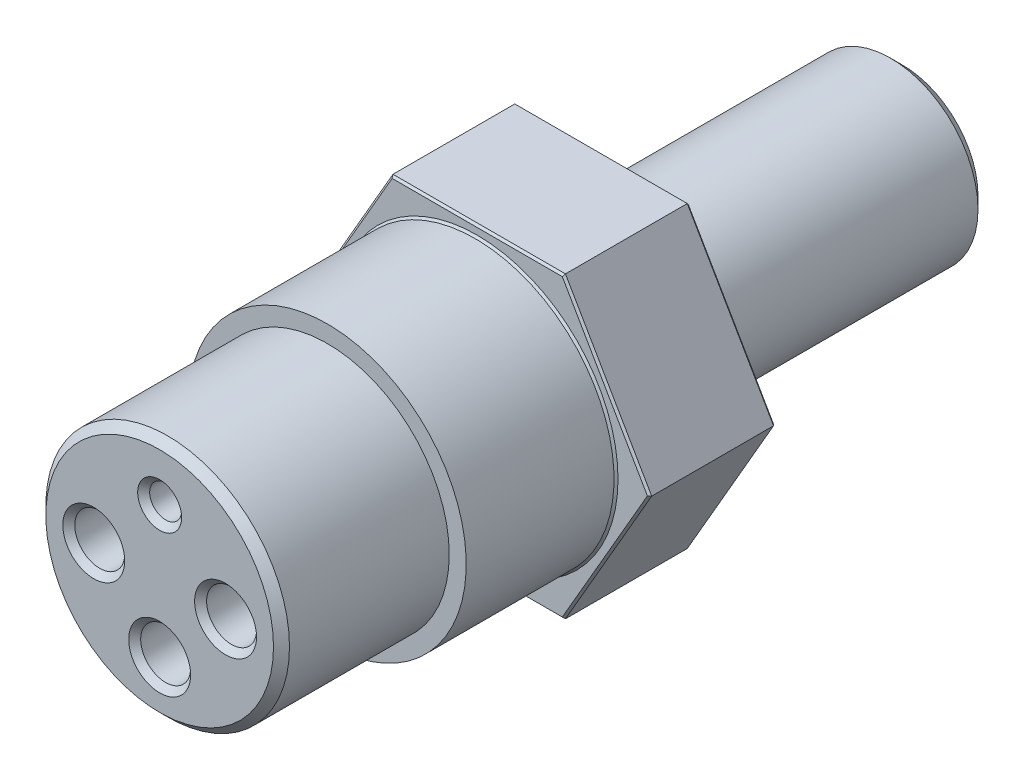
ISO-10303-21;
HEADER;
FILE_DESCRIPTION(('STEP AP214'),'2;1');
FILE_NAME('part.step','',(''),(''),'','','');
FILE_SCHEMA(('AUTOMOTIVE_DESIGN { 1 0 10303 214 1 1 1 1 }'));
ENDSEC;
DATA;
#1=APPLICATION_CONTEXT('core data for automotive mechanical design processes');
#2=APPLICATION_PROTOCOL_DEFINITION('international standard','automotive_design',2000,#1);
#3=PRODUCT_CONTEXT('',#1,'mechanical');
#4=PRODUCT('Part','Part','',(#3));
#5=PRODUCT_RELATED_PRODUCT_CATEGORY('part','',(#4));
#6=PRODUCT_DEFINITION_FORMATION('','',#4);
#7=PRODUCT_DEFINITION_CONTEXT('part definition',#1,'design');
#8=PRODUCT_DEFINITION('design','',#6,#7);
#9=PRODUCT_DEFINITION_SHAPE('','',#8);
#10=(LENGTH_UNIT() NAMED_UNIT(*) SI_UNIT(.MILLI.,.METRE.));
#11=(NAMED_UNIT(*) PLANE_ANGLE_UNIT() SI_UNIT($,.RADIAN.));
#12=(NAMED_UNIT(*) SI_UNIT($,.STERADIAN.) SOLID_ANGLE_UNIT());
#13=UNCERTAINTY_MEASURE_WITH_UNIT(LENGTH_MEASURE(1.E-05),#10,'distance_accuracy_value','');
#14=(GEOMETRIC_REPRESENTATION_CONTEXT(3) GLOBAL_UNCERTAINTY_ASSIGNED_CONTEXT((#13)) GLOBAL_UNIT_ASSIGNED_CONTEXT((#10,
#11,#12)) REPRESENTATION_CONTEXT('',''));
#15=CARTESIAN_POINT('',(0.,0.,0.));
#16=DIRECTION('',(0.,0.,1.));
#17=DIRECTION('',(1.,0.,0.));
#18=AXIS2_PLACEMENT_3D('',#15,#16,#17);
#19=CARTESIAN_POINT('',(0.,0.,17.526));
#20=DIRECTION('',(0.,0.,1.));
#21=DIRECTION('',(1.,0.,0.));
#22=AXIS2_PLACEMENT_3D('',#19,#20,#21);
#23=PLANE('',#22);
#24=CARTESIAN_POINT('',(0.,0.,17.526));
#25=DIRECTION('',(0.,0.,1.));
#26=DIRECTION('',(1.,0.,0.));
#27=AXIS2_PLACEMENT_3D('',#24,#25,#26);
#28=CIRCLE('',#27,8.8265);
#29=CARTESIAN_POINT('',(-8.8265,0.,17.526));
#30=VERTEX_POINT('',#29);
#31=EDGE_CURVE('E331',#30,#30,#28,.T.);
#32=ORIENTED_EDGE('',*,*,#31,.T.);
#33=EDGE_LOOP('',(#32));
#34=FACE_BOUND('',#33,.T.);
#35=CARTESIAN_POINT('',(0.,0.,17.526));
#36=DIRECTION('',(0.,0.,1.));
#37=DIRECTION('',(1.,0.,0.));
#38=AXIS2_PLACEMENT_3D('',#35,#36,#37);
#39=CIRCLE('',#38,7.747);
#40=CARTESIAN_POINT('',(7.747,0.,17.526));
#41=VERTEX_POINT('',#40);
#42=EDGE_CURVE('E367',#41,#41,#39,.T.);
#43=ORIENTED_EDGE('',*,*,#42,.F.);
#44=EDGE_LOOP('',(#43));
#45=FACE_BOUND('',#44,.T.);
#46=ADVANCED_FACE('F36',(#34,#45),#23,.T.);
#47=CARTESIAN_POINT('',(5.48459661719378,9.4996,8.001));
#48=DIRECTION('',(0.,0.,-1.));
#49=DIRECTION('',(-1.,0.,0.));
#50=AXIS2_PLACEMENT_3D('',#47,#48,#49);
#51=PLANE('',#50);
#52=CARTESIAN_POINT('',(0.,0.,8.001));
#53=DIRECTION('',(0.,0.,-1.));
#54=DIRECTION('',(-1.,0.,0.));
#55=AXIS2_PLACEMENT_3D('',#52,#53,#54);
#56=CIRCLE('',#55,8.95350000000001);
#57=CARTESIAN_POINT('',(-8.95350000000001,0.,8.001));
#58=VERTEX_POINT('',#57);
#59=EDGE_CURVE('E151',#58,#58,#56,.T.);
#60=ORIENTED_EDGE('',*,*,#59,.T.);
#61=EDGE_LOOP('',(#60));
#62=FACE_BOUND('',#61,.T.);
#63=DIRECTION('',(0.5,0.866025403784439,0.));
#64=VECTOR('',#63,1.);
#65=CARTESIAN_POINT('',(13.6015063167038,4.8133,8.001));
#66=LINE('',#65,#64);
#67=CARTESIAN_POINT('',(5.41127313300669,-9.3726,8.001));
#68=VERTEX_POINT('',#67);
#69=CARTESIAN_POINT('',(10.8225462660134,0.,8.001));
#70=VERTEX_POINT('',#69);
#71=EDGE_CURVE('E149',#68,#70,#66,.T.);
#72=ORIENTED_EDGE('',*,*,#71,.T.);
#73=DIRECTION('',(-0.5,0.866025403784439,0.));
#74=VECTOR('',#73,1.);
#75=CARTESIAN_POINT('',(5.37461139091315,9.4361,8.001));
#76=LINE('',#75,#74);
#77=CARTESIAN_POINT('',(5.41127313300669,9.37260000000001,8.001));
#78=VERTEX_POINT('',#77);
#79=EDGE_CURVE('E129',#70,#78,#76,.T.);
#80=ORIENTED_EDGE('',*,*,#79,.T.);
#81=DIRECTION('',(-1.,0.,0.));
#82=VECTOR('',#81,1.);
#83=CARTESIAN_POINT('',(5.48459661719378,9.37260000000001,8.001));
#84=LINE('',#83,#82);
#85=CARTESIAN_POINT('',(-5.41127313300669,9.3726,8.001));
#86=VERTEX_POINT('',#85);
#87=EDGE_CURVE('E138',#78,#86,#84,.T.);
#88=ORIENTED_EDGE('',*,*,#87,.T.);
#89=DIRECTION('',(-0.5,-0.866025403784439,0.));
#90=VECTOR('',#89,1.);
#91=CARTESIAN_POINT('',(-2.63231308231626,14.1859,8.001));
#92=LINE('',#91,#90);
#93=CARTESIAN_POINT('',(-10.8225462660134,0.,8.001));
#94=VERTEX_POINT('',#93);
#95=EDGE_CURVE('E144',#86,#94,#92,.T.);
#96=ORIENTED_EDGE('',*,*,#95,.T.);
#97=DIRECTION('',(0.5,-0.866025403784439,0.));
#98=VECTOR('',#97,1.);
#99=CARTESIAN_POINT('',(-10.8592080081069,0.0634999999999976,8.001));
#100=LINE('',#99,#98);
#101=CARTESIAN_POINT('',(-5.41127313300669,-9.3726,8.001));
#102=VERTEX_POINT('',#101);
#103=EDGE_CURVE('E307',#94,#102,#100,.T.);
#104=ORIENTED_EDGE('',*,*,#103,.T.);
#105=DIRECTION('',(1.,0.,0.));
#106=VECTOR('',#105,1.);
#107=CARTESIAN_POINT('',(5.48459661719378,-9.3726,8.001));
#108=LINE('',#107,#106);
#109=EDGE_CURVE('E156',#102,#68,#108,.T.);
#110=ORIENTED_EDGE('',*,*,#109,.T.);
#111=EDGE_LOOP('',(#72,#80,#88,#96,#104,#110));
#112=FACE_BOUND('',#111,.T.);
#113=ADVANCED_FACE('F147',(#62,#112),#51,.F.);
#114=CARTESIAN_POINT('',(0.,0.,-19.05));
#115=DIRECTION('',(0.,0.,1.));
#116=DIRECTION('',(1.,0.,0.));
#117=AXIS2_PLACEMENT_3D('',#114,#115,#116);
#118=CYLINDRICAL_SURFACE('',#117,5.55625);
#119=CARTESIAN_POINT('',(0.,0.,-18.288));
#120=DIRECTION('',(0.,0.,1.));
#121=DIRECTION('',(1.,0.,0.));
#122=AXIS2_PLACEMENT_3D('',#119,#120,#121);
#123=CIRCLE('',#122,5.55625);
#124=CARTESIAN_POINT('',(5.55625,0.,-18.288));
#125=VERTEX_POINT('',#124);
#126=EDGE_CURVE('E297',#125,#125,#123,.T.);
#127=CARTESIAN_POINT('',(0.,0.,0.));
#128=DIRECTION('',(0.,0.,1.));
#129=DIRECTION('',(1.,0.,0.));
#130=AXIS2_PLACEMENT_3D('',#127,#128,#129);
#131=CIRCLE('',#130,5.55625);
#132=CARTESIAN_POINT('',(5.55625,0.,0.));
#133=VERTEX_POINT('',#132);
#134=EDGE_CURVE('E302',#133,#133,#131,.T.);
#135=CARTESIAN_POINT('',(5.55625,0.,-18.288));
#136=CARTESIAN_POINT('',(5.55625,0.,-18.0975));
#137=CARTESIAN_POINT('',(5.55625,0.,-17.907));
#138=CARTESIAN_POINT('',(5.55625,0.,-17.526));
#139=CARTESIAN_POINT('',(5.55625,0.,-17.3355));
#140=CARTESIAN_POINT('',(5.55625,0.,-16.9545));
#141=CARTESIAN_POINT('',(5.55625,0.,-16.764));
#142=CARTESIAN_POINT('',(5.55625,0.,-16.383));
#143=CARTESIAN_POINT('',(5.55625,0.,-16.1925));
#144=CARTESIAN_POINT('',(5.55625,0.,-15.8115));
#145=CARTESIAN_POINT('',(5.55625,0.,-15.621));
#146=CARTESIAN_POINT('',(5.55625,0.,-15.24));
#147=CARTESIAN_POINT('',(5.55625,0.,-15.0495));
#148=CARTESIAN_POINT('',(5.55625,0.,-14.6685));
#149=CARTESIAN_POINT('',(5.55625,0.,-14.478));
#150=CARTESIAN_POINT('',(5.55625,0.,-14.097));
#151=CARTESIAN_POINT('',(5.55625,0.,-13.9065));
#152=CARTESIAN_POINT('',(5.55625,0.,-13.5255));
#153=CARTESIAN_POINT('',(5.55625,0.,-13.335));
#154=CARTESIAN_POINT('',(5.55625,0.,-12.954));
#155=CARTESIAN_POINT('',(5.55625,0.,-12.7635));
#156=CARTESIAN_POINT('',(5.55625,0.,-12.3825));
#157=CARTESIAN_POINT('',(5.55625,0.,-12.192));
#158=CARTESIAN_POINT('',(5.55625,0.,-11.811));
#159=CARTESIAN_POINT('',(5.55625,0.,-11.6205));
#160=CARTESIAN_POINT('',(5.55625,0.,-11.2395));
#161=CARTESIAN_POINT('',(5.55625,0.,-11.049));
#162=CARTESIAN_POINT('',(5.55625,0.,-10.668));
#163=CARTESIAN_POINT('',(5.55625,0.,-10.4775));
#164=CARTESIAN_POINT('',(5.55625,0.,-10.0965));
#165=CARTESIAN_POINT('',(5.55625,0.,-9.906));
#166=CARTESIAN_POINT('',(5.55625,0.,-9.525));
#167=CARTESIAN_POINT('',(5.55625,0.,-9.3345));
#168=CARTESIAN_POINT('',(5.55625,0.,-8.9535));
#169=CARTESIAN_POINT('',(5.55625,0.,-8.763));
#170=CARTESIAN_POINT('',(5.55625,0.,-8.382));
#171=CARTESIAN_POINT('',(5.55625,0.,-8.1915));
#172=CARTESIAN_POINT('',(5.55625,0.,-7.8105));
#173=CARTESIAN_POINT('',(5.55625,0.,-7.62));
#174=CARTESIAN_POINT('',(5.55625,0.,-7.239));
#175=CARTESIAN_POINT('',(5.55625,0.,-7.0485));
#176=CARTESIAN_POINT('',(5.55625,0.,-6.6675));
#177=CARTESIAN_POINT('',(5.55625,0.,-6.477));
#178=CARTESIAN_POINT('',(5.55625,0.,-6.096));
#179=CARTESIAN_POINT('',(5.55625,0.,-5.9055));
#180=CARTESIAN_POINT('',(5.55625,0.,-5.5245));
#181=CARTESIAN_POINT('',(5.55625,0.,-5.334));
#182=CARTESIAN_POINT('',(5.55625,0.,-4.953));
#183=CARTESIAN_POINT('',(5.55625,0.,-4.7625));
#184=CARTESIAN_POINT('',(5.55625,0.,-4.3815));
#185=CARTESIAN_POINT('',(5.55625,0.,-4.191));
#186=CARTESIAN_POINT('',(5.55625,0.,-3.81));
#187=CARTESIAN_POINT('',(5.55625,0.,-3.6195));
#188=CARTESIAN_POINT('',(5.55625,0.,-3.2385));
#189=CARTESIAN_POINT('',(5.55625,0.,-3.048));
#190=CARTESIAN_POINT('',(5.55625,0.,-2.667));
#191=CARTESIAN_POINT('',(5.55625,0.,-2.4765));
#192=CARTESIAN_POINT('',(5.55625,0.,-2.0955));
#193=CARTESIAN_POINT('',(5.55625,0.,-1.905));
#194=CARTESIAN_POINT('',(5.55625,0.,-1.524));
#195=CARTESIAN_POINT('',(5.55625,0.,-1.3335));
#196=CARTESIAN_POINT('',(5.55625,0.,-0.952499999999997));
#197=CARTESIAN_POINT('',(5.55625,0.,-0.761999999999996));
#198=CARTESIAN_POINT('',(5.55625,0.,-0.380999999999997));
#199=CARTESIAN_POINT('',(5.55625,0.,-0.190499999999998));
#200=CARTESIAN_POINT('',(5.55625,0.,0.));
#201=B_SPLINE_CURVE_WITH_KNOTS('',3,(#135,#136,#137,#138,#139,#140,#141,#142,#143,#144,#145,
#146,#147,#148,#149,#150,#151,#152,#153,#154,#155,#156,#157,#158,#159,#160,#161,#162,#163,#164,
#165,#166,#167,#168,#169,#170,#171,#172,#173,#174,#175,#176,#177,#178,#179,#180,#181,#182,#183,
#184,#185,#186,#187,#188,#189,#190,#191,#192,#193,#194,#195,#196,#197,#198,#199,#200),
.UNSPECIFIED.,.F.,.F.,(4,2,2,2,2,2,2,2,2,2,2,2,2,2,2,2,2,2,2,2,2,2,2,2,2,2,2,2,2,2,2,2,4),(0.,
0.571500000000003,1.143,1.7145,2.286,2.8575,3.429,4.0005,4.572,5.1435,5.715,6.2865,6.858,7.4295,
8.001,8.5725,9.144,9.7155,10.287,10.8585,11.43,12.0015,12.573,13.1445,13.716,14.2875,14.859,
15.4305,16.002,16.5735,17.145,17.7165,18.288),.UNSPECIFIED.);
#202=EDGE_CURVE('BSEAM38',#125,#133,#201,.T.);
#203=ORIENTED_EDGE('',*,*,#126,.T.);
#204=ORIENTED_EDGE('',*,*,#134,.F.);
#205=ORIENTED_EDGE('',*,*,#202,.T.);
#206=ORIENTED_EDGE('',*,*,#202,.F.);
#207=EDGE_LOOP('',(#203,#205,#204,#206));
#208=FACE_BOUND('',#207,.T.);
#209=ADVANCED_FACE('F38',(#208),#118,.T.);
#210=CARTESIAN_POINT('',(0.,0.,-19.05));
#211=DIRECTION('',(0.,0.,1.));
#212=DIRECTION('',(1.,0.,0.));
#213=AXIS2_PLACEMENT_3D('',#210,#211,#212);
#214=PLANE('',#213);
#215=CARTESIAN_POINT('',(0.,0.,-19.05));
#216=DIRECTION('',(0.,0.,1.));
#217=DIRECTION('',(1.,0.,0.));
#218=AXIS2_PLACEMENT_3D('',#215,#216,#217);
#219=CIRCLE('',#218,4.79425);
#220=CARTESIAN_POINT('',(4.79425,0.,-19.05));
#221=VERTEX_POINT('',#220);
#222=EDGE_CURVE('E296',#221,#221,#219,.F.);
#223=ORIENTED_EDGE('',*,*,#222,.T.);
#224=EDGE_LOOP('',(#223));
#225=FACE_BOUND('',#224,.T.);
#226=ADVANCED_FACE('F286',(#225),#214,.F.);
#227=CARTESIAN_POINT('',(0.,0.,-18.288));
#228=DIRECTION('',(0.,0.,1.));
#229=DIRECTION('',(1.,0.,0.));
#230=AXIS2_PLACEMENT_3D('',#227,#228,#229);
#231=CONICAL_SURFACE('',#230,5.55625,0.785398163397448);
#232=ORIENTED_EDGE('',*,*,#222,.F.);
#233=EDGE_LOOP('',(#232));
#234=FACE_BOUND('',#233,.T.);
#235=ORIENTED_EDGE('',*,*,#126,.F.);
#236=EDGE_LOOP('',(#235));
#237=FACE_BOUND('',#236,.T.);
#238=ADVANCED_FACE('F283',(#234,#237),#231,.T.);
#239=CARTESIAN_POINT('',(5.48459661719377,9.4996,8.001));
#240=DIRECTION('',(0.,-1.,0.));
#241=DIRECTION('',(1.,0.,0.));
#242=AXIS2_PLACEMENT_3D('',#239,#240,#241);
#243=PLANE('',#242);
#244=DIRECTION('',(0.,0.,-1.));
#245=VECTOR('',#244,1.);
#246=CARTESIAN_POINT('',(-5.48459661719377,9.4996,8.001));
#247=LINE('',#246,#245);
#248=CARTESIAN_POINT('',(-5.48459661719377,9.4996,7.874));
#249=VERTEX_POINT('',#248);
#250=CARTESIAN_POINT('',(-5.48459661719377,9.4996,0.126999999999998));
#251=VERTEX_POINT('',#250);
#252=EDGE_CURVE('E351',#249,#251,#247,.T.);
#253=ORIENTED_EDGE('',*,*,#252,.F.);
#254=DIRECTION('',(1.,0.,0.));
#255=VECTOR('',#254,1.);
#256=CARTESIAN_POINT('',(5.48459661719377,9.4996,7.874));
#257=LINE('',#256,#255);
#258=CARTESIAN_POINT('',(5.48459661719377,9.4996,7.874));
#259=VERTEX_POINT('',#258);
#260=EDGE_CURVE('E183',#249,#259,#257,.T.);
#261=ORIENTED_EDGE('',*,*,#260,.T.);
#262=DIRECTION('',(0.,0.,-1.));
#263=VECTOR('',#262,1.);
#264=CARTESIAN_POINT('',(5.48459661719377,9.4996,8.001));
#265=LINE('',#264,#263);
#266=CARTESIAN_POINT('',(5.48459661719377,9.4996,0.127));
#267=VERTEX_POINT('',#266);
#268=EDGE_CURVE('E336',#259,#267,#265,.T.);
#269=ORIENTED_EDGE('',*,*,#268,.T.);
#270=DIRECTION('',(-1.,0.,0.));
#271=VECTOR('',#270,1.);
#272=CARTESIAN_POINT('',(-5.48459661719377,9.4996,0.127));
#273=LINE('',#272,#271);
#274=EDGE_CURVE('E180',#267,#251,#273,.T.);
#275=ORIENTED_EDGE('',*,*,#274,.T.);
#276=EDGE_LOOP('',(#253,#261,#269,#275));
#277=FACE_BOUND('',#276,.T.);
#278=ADVANCED_FACE('F279',(#277),#243,.F.);
#279=CARTESIAN_POINT('',(-5.48459661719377,9.4996,8.001));
#280=DIRECTION('',(0.866025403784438,-0.5,0.));
#281=DIRECTION('',(0.5,0.866025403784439,0.));
#282=AXIS2_PLACEMENT_3D('',#279,#280,#281);
#283=PLANE('',#282);
#284=DIRECTION('',(0.,0.,-1.));
#285=VECTOR('',#284,1.);
#286=CARTESIAN_POINT('',(-10.9691932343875,0.,8.001));
#287=LINE('',#286,#285);
#288=CARTESIAN_POINT('',(-10.9691932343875,0.,7.874));
#289=VERTEX_POINT('',#288);
#290=CARTESIAN_POINT('',(-10.9691932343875,0.,0.127000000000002));
#291=VERTEX_POINT('',#290);
#292=EDGE_CURVE('E348',#289,#291,#287,.T.);
#293=ORIENTED_EDGE('',*,*,#292,.F.);
#294=DIRECTION('',(0.5,0.866025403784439,0.));
#295=VECTOR('',#294,1.);
#296=CARTESIAN_POINT('',(-5.48459661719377,9.4996,7.874));
#297=LINE('',#296,#295);
#298=EDGE_CURVE('E178',#289,#249,#297,.T.);
#299=ORIENTED_EDGE('',*,*,#298,.T.);
#300=ORIENTED_EDGE('',*,*,#252,.T.);
#301=DIRECTION('',(-0.377964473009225,-0.654653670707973,-0.654653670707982));
#302=VECTOR('',#301,1.);
#303=CARTESIAN_POINT('',(-3.91756901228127,12.2137714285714,2.84117142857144));
#304=LINE('',#303,#302);
#305=CARTESIAN_POINT('',(-5.55792010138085,9.3726,0.));
#306=VERTEX_POINT('',#305);
#307=EDGE_CURVE('E176',#251,#306,#304,.T.);
#308=ORIENTED_EDGE('',*,*,#307,.T.);
#309=DIRECTION('',(-0.5,-0.866025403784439,0.));
#310=VECTOR('',#309,1.);
#311=CARTESIAN_POINT('',(-5.48459661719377,9.4996,0.));
#312=LINE('',#311,#310);
#313=CARTESIAN_POINT('',(-10.8958697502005,0.127000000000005,0.));
#314=VERTEX_POINT('',#313);
#315=EDGE_CURVE('E333',#306,#314,#312,.T.);
#316=ORIENTED_EDGE('',*,*,#315,.T.);
#317=DIRECTION('',(-0.377964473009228,-0.654653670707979,0.654653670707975));
#318=VECTOR('',#317,1.);
#319=CARTESIAN_POINT('',(-10.9691932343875,0.,0.127000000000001));
#320=LINE('',#319,#318);
#321=EDGE_CURVE('E174',#314,#291,#320,.T.);
#322=ORIENTED_EDGE('',*,*,#321,.T.);
#323=EDGE_LOOP('',(#293,#299,#300,#308,#316,#322));
#324=FACE_BOUND('',#323,.T.);
#325=ADVANCED_FACE('F275',(#324),#283,.F.);
#326=CARTESIAN_POINT('',(-10.9691932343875,0.,8.001));
#327=DIRECTION('',(0.866025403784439,0.5,0.));
#328=DIRECTION('',(-0.5,0.866025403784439,0.));
#329=AXIS2_PLACEMENT_3D('',#326,#327,#328);
#330=PLANE('',#329);
#331=DIRECTION('',(0.,0.,-1.));
#332=VECTOR('',#331,1.);
#333=CARTESIAN_POINT('',(-5.48459661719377,-9.4996,8.001));
#334=LINE('',#333,#332);
#335=CARTESIAN_POINT('',(-5.48459661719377,-9.4996,7.874));
#336=VERTEX_POINT('',#335);
#337=CARTESIAN_POINT('',(-5.48459661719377,-9.4996,0.127));
#338=VERTEX_POINT('',#337);
#339=EDGE_CURVE('E345',#336,#338,#334,.T.);
#340=ORIENTED_EDGE('',*,*,#339,.F.);
#341=DIRECTION('',(-0.5,0.866025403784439,0.));
#342=VECTOR('',#341,1.);
#343=CARTESIAN_POINT('',(-10.9691932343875,0.,7.874));
#344=LINE('',#343,#342);
#345=EDGE_CURVE('E172',#336,#289,#344,.T.);
#346=ORIENTED_EDGE('',*,*,#345,.T.);
#347=ORIENTED_EDGE('',*,*,#292,.T.);
#348=DIRECTION('',(0.5,-0.866025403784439,0.));
#349=VECTOR('',#348,1.);
#350=CARTESIAN_POINT('',(-5.48459661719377,-9.4996,0.127));
#351=LINE('',#350,#349);
#352=EDGE_CURVE('E170',#291,#338,#351,.T.);
#353=ORIENTED_EDGE('',*,*,#352,.T.);
#354=EDGE_LOOP('',(#340,#346,#347,#353));
#355=FACE_BOUND('',#354,.T.);
#356=ADVANCED_FACE('F271',(#355),#330,.F.);
#357=CARTESIAN_POINT('',(-5.48459661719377,-9.4996,8.001));
#358=DIRECTION('',(0.,1.,0.));
#359=DIRECTION('',(-1.,0.,0.));
#360=AXIS2_PLACEMENT_3D('',#357,#358,#359);
#361=PLANE('',#360);
#362=DIRECTION('',(0.,0.,-1.));
#363=VECTOR('',#362,1.);
#364=CARTESIAN_POINT('',(5.48459661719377,-9.4996,8.001));
#365=LINE('',#364,#363);
#366=CARTESIAN_POINT('',(5.48459661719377,-9.4996,7.874));
#367=VERTEX_POINT('',#366);
#368=CARTESIAN_POINT('',(5.48459661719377,-9.4996,0.127));
#369=VERTEX_POINT('',#368);
#370=EDGE_CURVE('E342',#367,#369,#365,.T.);
#371=ORIENTED_EDGE('',*,*,#370,.F.);
#372=DIRECTION('',(-1.,0.,0.));
#373=VECTOR('',#372,1.);
#374=CARTESIAN_POINT('',(-5.48459661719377,-9.4996,7.874));
#375=LINE('',#374,#373);
#376=EDGE_CURVE('E168',#367,#336,#375,.T.);
#377=ORIENTED_EDGE('',*,*,#376,.T.);
#378=ORIENTED_EDGE('',*,*,#339,.T.);
#379=DIRECTION('',(1.,0.,0.));
#380=VECTOR('',#379,1.);
#381=CARTESIAN_POINT('',(5.48459661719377,-9.4996,0.127));
#382=LINE('',#381,#380);
#383=EDGE_CURVE('E166',#338,#369,#382,.T.);
#384=ORIENTED_EDGE('',*,*,#383,.T.);
#385=EDGE_LOOP('',(#371,#377,#378,#384));
#386=FACE_BOUND('',#385,.T.);
#387=ADVANCED_FACE('F267',(#386),#361,.F.);
#388=CARTESIAN_POINT('',(5.48459661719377,-9.4996,8.001));
#389=DIRECTION('',(-0.866025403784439,0.5,0.));
#390=DIRECTION('',(-0.5,-0.866025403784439,0.));
#391=AXIS2_PLACEMENT_3D('',#388,#389,#390);
#392=PLANE('',#391);
#393=DIRECTION('',(0.,0.,-1.));
#394=VECTOR('',#393,1.);
#395=CARTESIAN_POINT('',(10.9691932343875,0.,8.001));
#396=LINE('',#395,#394);
#397=CARTESIAN_POINT('',(10.9691932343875,0.,7.874));
#398=VERTEX_POINT('',#397);
#399=CARTESIAN_POINT('',(10.9691932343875,0.,0.127));
#400=VERTEX_POINT('',#399);
#401=EDGE_CURVE('E339',#398,#400,#396,.T.);
#402=ORIENTED_EDGE('',*,*,#401,.F.);
#403=DIRECTION('',(-0.5,-0.866025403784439,0.));
#404=VECTOR('',#403,1.);
#405=CARTESIAN_POINT('',(5.48459661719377,-9.4996,7.874));
#406=LINE('',#405,#404);
#407=EDGE_CURVE('E164',#398,#367,#406,.T.);
#408=ORIENTED_EDGE('',*,*,#407,.T.);
#409=ORIENTED_EDGE('',*,*,#370,.T.);
#410=DIRECTION('',(0.5,0.866025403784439,0.));
#411=VECTOR('',#410,1.);
#412=CARTESIAN_POINT('',(10.9691932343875,0.,0.127));
#413=LINE('',#412,#411);
#414=EDGE_CURVE('E162',#369,#400,#413,.T.);
#415=ORIENTED_EDGE('',*,*,#414,.T.);
#416=EDGE_LOOP('',(#402,#408,#409,#415));
#417=FACE_BOUND('',#416,.T.);
#418=ADVANCED_FACE('F263',(#417),#392,.F.);
#419=CARTESIAN_POINT('',(10.9691932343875,0.,8.001));
#420=DIRECTION('',(-0.866025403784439,-0.5,0.));
#421=DIRECTION('',(0.5,-0.866025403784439,0.));
#422=AXIS2_PLACEMENT_3D('',#419,#420,#421);
#423=PLANE('',#422);
#424=ORIENTED_EDGE('',*,*,#268,.F.);
#425=DIRECTION('',(0.5,-0.866025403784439,0.));
#426=VECTOR('',#425,1.);
#427=CARTESIAN_POINT('',(10.9691932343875,0.,7.874));
#428=LINE('',#427,#426);
#429=EDGE_CURVE('E131',#259,#398,#428,.T.);
#430=ORIENTED_EDGE('',*,*,#429,.T.);
#431=ORIENTED_EDGE('',*,*,#401,.T.);
#432=DIRECTION('',(-0.5,0.866025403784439,0.));
#433=VECTOR('',#432,1.);
#434=CARTESIAN_POINT('',(5.48459661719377,9.4996,0.127));
#435=LINE('',#434,#433);
#436=EDGE_CURVE('E154',#400,#267,#435,.T.);
#437=ORIENTED_EDGE('',*,*,#436,.T.);
#438=EDGE_LOOP('',(#424,#430,#431,#437));
#439=FACE_BOUND('',#438,.T.);
#440=ADVANCED_FACE('F258',(#439),#423,.F.);
#441=CARTESIAN_POINT('',(5.48459661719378,9.4996,0.));
#442=DIRECTION('',(0.,0.,-1.));
#443=DIRECTION('',(-1.,0.,0.));
#444=AXIS2_PLACEMENT_3D('',#441,#442,#443);
#445=PLANE('',#444);
#446=ORIENTED_EDGE('',*,*,#134,.T.);
#447=EDGE_LOOP('',(#446));
#448=FACE_BOUND('',#447,.T.);
#449=ORIENTED_EDGE('',*,*,#315,.F.);
#450=DIRECTION('',(1.,0.,0.));
#451=VECTOR('',#450,1.);
#452=CARTESIAN_POINT('',(5.48459661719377,9.37260000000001,0.));
#453=LINE('',#452,#451);
#454=CARTESIAN_POINT('',(5.41127313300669,9.37260000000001,0.));
#455=VERTEX_POINT('',#454);
#456=EDGE_CURVE('E51',#306,#455,#453,.T.);
#457=ORIENTED_EDGE('',*,*,#456,.T.);
#458=DIRECTION('',(0.5,-0.866025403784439,0.));
#459=VECTOR('',#458,1.);
#460=CARTESIAN_POINT('',(10.8592080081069,-0.0634999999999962,0.));
#461=LINE('',#460,#459);
#462=CARTESIAN_POINT('',(10.8225462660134,0.,0.));
#463=VERTEX_POINT('',#462);
#464=EDGE_CURVE('E55',#455,#463,#461,.T.);
#465=ORIENTED_EDGE('',*,*,#464,.T.);
#466=DIRECTION('',(-0.5,-0.866025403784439,0.));
#467=VECTOR('',#466,1.);
#468=CARTESIAN_POINT('',(5.37461139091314,-9.43609999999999,0.));
#469=LINE('',#468,#467);
#470=CARTESIAN_POINT('',(5.41127313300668,-9.3726,0.));
#471=VERTEX_POINT('',#470);
#472=EDGE_CURVE('E189',#463,#471,#469,.T.);
#473=ORIENTED_EDGE('',*,*,#472,.T.);
#474=DIRECTION('',(-1.,0.,0.));
#475=VECTOR('',#474,1.);
#476=CARTESIAN_POINT('',(-5.48459661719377,-9.3726,0.));
#477=LINE('',#476,#475);
#478=CARTESIAN_POINT('',(-5.41127313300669,-9.3726,0.));
#479=VERTEX_POINT('',#478);
#480=EDGE_CURVE('E187',#471,#479,#477,.T.);
#481=ORIENTED_EDGE('',*,*,#480,.T.);
#482=DIRECTION('',(-0.5,0.866025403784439,0.));
#483=VECTOR('',#482,1.);
#484=CARTESIAN_POINT('',(-10.8592080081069,0.0635000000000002,0.));
#485=LINE('',#484,#483);
#486=EDGE_CURVE('E185',#479,#314,#485,.T.);
#487=ORIENTED_EDGE('',*,*,#486,.T.);
#488=EDGE_LOOP('',(#449,#457,#465,#473,#481,#487));
#489=FACE_BOUND('',#488,.T.);
#490=ADVANCED_FACE('F255',(#448,#489),#445,.T.);
#491=CARTESIAN_POINT('',(0.,0.,17.526));
#492=DIRECTION('',(0.,0.,-1.));
#493=DIRECTION('',(-1.,0.,0.));
#494=AXIS2_PLACEMENT_3D('',#491,#492,#493);
#495=CYLINDRICAL_SURFACE('',#494,8.8265);
#496=CARTESIAN_POINT('',(0.,0.,8.12800000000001));
#497=DIRECTION('',(0.,0.,-1.));
#498=DIRECTION('',(-1.,0.,0.));
#499=AXIS2_PLACEMENT_3D('',#496,#497,#498);
#500=CIRCLE('',#499,8.8265);
#501=CARTESIAN_POINT('',(-8.8265,0.,8.12800000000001));
#502=VERTEX_POINT('',#501);
#503=EDGE_CURVE('E145',#502,#502,#500,.F.);
#504=CARTESIAN_POINT('',(-8.8265,0.,8.12800000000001));
#505=CARTESIAN_POINT('',(-8.8265,0.,8.22589583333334));
#506=CARTESIAN_POINT('',(-8.8265,0.,8.32379166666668));
#507=CARTESIAN_POINT('',(-8.8265,0.,8.51958333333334));
#508=CARTESIAN_POINT('',(-8.8265,0.,8.61747916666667));
#509=CARTESIAN_POINT('',(-8.8265,0.,8.81327083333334));
#510=CARTESIAN_POINT('',(-8.8265,0.,8.91116666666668));
#511=CARTESIAN_POINT('',(-8.8265,0.,9.10695833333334));
#512=CARTESIAN_POINT('',(-8.8265,0.,9.20485416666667));
#513=CARTESIAN_POINT('',(-8.8265,0.,9.40064583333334));
#514=CARTESIAN_POINT('',(-8.8265,0.,9.49854166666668));
#515=CARTESIAN_POINT('',(-8.8265,0.,9.69433333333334));
#516=CARTESIAN_POINT('',(-8.8265,0.,9.79222916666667));
#517=CARTESIAN_POINT('',(-8.8265,0.,9.98802083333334));
#518=CARTESIAN_POINT('',(-8.8265,0.,10.0859166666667));
#519=CARTESIAN_POINT('',(-8.8265,0.,10.2817083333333));
#520=CARTESIAN_POINT('',(-8.8265,0.,10.3796041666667));
#521=CARTESIAN_POINT('',(-8.8265,0.,10.5753958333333));
#522=CARTESIAN_POINT('',(-8.8265,0.,10.6732916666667));
#523=CARTESIAN_POINT('',(-8.8265,0.,10.8690833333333));
#524=CARTESIAN_POINT('',(-8.8265,0.,10.9669791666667));
#525=CARTESIAN_POINT('',(-8.8265,0.,11.1627708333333));
#526=CARTESIAN_POINT('',(-8.8265,0.,11.2606666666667));
#527=CARTESIAN_POINT('',(-8.8265,0.,11.4564583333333));
#528=CARTESIAN_POINT('',(-8.8265,0.,11.5543541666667));
#529=CARTESIAN_POINT('',(-8.8265,0.,11.7501458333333));
#530=CARTESIAN_POINT('',(-8.8265,0.,11.8480416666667));
#531=CARTESIAN_POINT('',(-8.8265,0.,12.0438333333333));
#532=CARTESIAN_POINT('',(-8.8265,0.,12.1417291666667));
#533=CARTESIAN_POINT('',(-8.8265,0.,12.3375208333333));
#534=CARTESIAN_POINT('',(-8.8265,0.,12.4354166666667));
#535=CARTESIAN_POINT('',(-8.8265,0.,12.6312083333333));
#536=CARTESIAN_POINT('',(-8.8265,0.,12.7291041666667));
#537=CARTESIAN_POINT('',(-8.8265,0.,12.9248958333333));
#538=CARTESIAN_POINT('',(-8.8265,0.,13.0227916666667));
#539=CARTESIAN_POINT('',(-8.8265,0.,13.2185833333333));
#540=CARTESIAN_POINT('',(-8.8265,0.,13.3164791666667));
#541=CARTESIAN_POINT('',(-8.8265,0.,13.5122708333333));
#542=CARTESIAN_POINT('',(-8.8265,0.,13.6101666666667));
#543=CARTESIAN_POINT('',(-8.8265,0.,13.8059583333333));
#544=CARTESIAN_POINT('',(-8.8265,0.,13.9038541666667));
#545=CARTESIAN_POINT('',(-8.8265,0.,14.0996458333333));
#546=CARTESIAN_POINT('',(-8.8265,0.,14.1975416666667));
#547=CARTESIAN_POINT('',(-8.8265,0.,14.3933333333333));
#548=CARTESIAN_POINT('',(-8.8265,0.,14.4912291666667));
#549=CARTESIAN_POINT('',(-8.8265,0.,14.6870208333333));
#550=CARTESIAN_POINT('',(-8.8265,0.,14.7849166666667));
#551=CARTESIAN_POINT('',(-8.8265,0.,14.9807083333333));
#552=CARTESIAN_POINT('',(-8.8265,0.,15.0786041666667));
#553=CARTESIAN_POINT('',(-8.8265,0.,15.2743958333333));
#554=CARTESIAN_POINT('',(-8.8265,0.,15.3722916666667));
#555=CARTESIAN_POINT('',(-8.8265,0.,15.5680833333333));
#556=CARTESIAN_POINT('',(-8.8265,0.,15.6659791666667));
#557=CARTESIAN_POINT('',(-8.8265,0.,15.8617708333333));
#558=CARTESIAN_POINT('',(-8.8265,0.,15.9596666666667));
#559=CARTESIAN_POINT('',(-8.8265,0.,16.1554583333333));
#560=CARTESIAN_POINT('',(-8.8265,0.,16.2533541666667));
#561=CARTESIAN_POINT('',(-8.8265,0.,16.4491458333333));
#562=CARTESIAN_POINT('',(-8.8265,0.,16.5470416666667));
#563=CARTESIAN_POINT('',(-8.8265,0.,16.7428333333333));
#564=CARTESIAN_POINT('',(-8.8265,0.,16.8407291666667));
#565=CARTESIAN_POINT('',(-8.8265,0.,17.0365208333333));
#566=CARTESIAN_POINT('',(-8.8265,0.,17.1344166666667));
#567=CARTESIAN_POINT('',(-8.8265,0.,17.3302083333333));
#568=CARTESIAN_POINT('',(-8.8265,0.,17.4281041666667));
#569=CARTESIAN_POINT('',(-8.8265,0.,17.526));
#570=B_SPLINE_CURVE_WITH_KNOTS('',3,(#504,#505,#506,#507,#508,#509,#510,#511,#512,#513,#514,
#515,#516,#517,#518,#519,#520,#521,#522,#523,#524,#525,#526,#527,#528,#529,#530,#531,#532,#533,
#534,#535,#536,#537,#538,#539,#540,#541,#542,#543,#544,#545,#546,#547,#548,#549,#550,#551,#552,
#553,#554,#555,#556,#557,#558,#559,#560,#561,#562,#563,#564,#565,#566,#567,#568,#569),
.UNSPECIFIED.,.F.,.F.,(4,2,2,2,2,2,2,2,2,2,2,2,2,2,2,2,2,2,2,2,2,2,2,2,2,2,2,2,2,2,2,2,4),(0.,
0.293687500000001,0.587374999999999,0.8810625,1.17475,1.4684375,1.762125,2.0558125,2.3495,
2.6431875,2.936875,3.2305625,3.52425,3.81793749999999,4.111625,4.4053125,4.69899999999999,
4.99268749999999,5.28637499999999,5.58006249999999,5.87374999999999,6.16743749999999,
6.46112499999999,6.75481249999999,7.04849999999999,7.34218749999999,7.63587499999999,
7.92956249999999,8.22324999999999,8.51693749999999,8.81062499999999,9.10431249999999,
9.39799999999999),.UNSPECIFIED.);
#571=EDGE_CURVE('BSEAM252',#502,#30,#570,.T.);
#572=ORIENTED_EDGE('',*,*,#503,.T.);
#573=ORIENTED_EDGE('',*,*,#31,.F.);
#574=ORIENTED_EDGE('',*,*,#571,.T.);
#575=ORIENTED_EDGE('',*,*,#571,.F.);
#576=EDGE_LOOP('',(#572,#574,#573,#575));
#577=FACE_BOUND('',#576,.T.);
#578=ADVANCED_FACE('F252',(#577),#495,.T.);
#579=CARTESIAN_POINT('',(0.,0.,8.12800000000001));
#580=DIRECTION('',(0.,0.,-1.));
#581=DIRECTION('',(-1.,0.,0.));
#582=AXIS2_PLACEMENT_3D('',#579,#580,#581);
#583=CONICAL_SURFACE('',#582,8.8265,0.785398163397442);
#584=ORIENTED_EDGE('',*,*,#59,.F.);
#585=EDGE_LOOP('',(#584));
#586=FACE_BOUND('',#585,.T.);
#587=ORIENTED_EDGE('',*,*,#503,.F.);
#588=EDGE_LOOP('',(#587));
#589=FACE_BOUND('',#588,.T.);
#590=ADVANCED_FACE('F250',(#586,#589),#583,.T.);
#591=CARTESIAN_POINT('',(-10.8592080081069,0.0634999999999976,8.001));
#592=DIRECTION('',(0.612372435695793,0.353553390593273,-0.707106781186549));
#593=DIRECTION('',(-0.755928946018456,0.,-0.654653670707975));
#594=AXIS2_PLACEMENT_3D('',#591,#592,#593);
#595=PLANE('',#594);
#596=DIRECTION('',(0.755928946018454,0.,0.654653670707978));
#597=VECTOR('',#596,1.);
#598=CARTESIAN_POINT('',(-6.14241301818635,0.,12.0541142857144));
#599=LINE('',#598,#597);
#600=EDGE_CURVE('E320',#289,#94,#599,.T.);
#601=ORIENTED_EDGE('',*,*,#600,.F.);
#602=ORIENTED_EDGE('',*,*,#345,.F.);
#603=DIRECTION('',(0.377964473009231,0.654653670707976,0.654653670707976));
#604=VECTOR('',#603,1.);
#605=CARTESIAN_POINT('',(-3.85472031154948,-6.67657142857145,10.6970285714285));
#606=LINE('',#605,#604);
#607=EDGE_CURVE('E329',#102,#336,#606,.F.);
#608=ORIENTED_EDGE('',*,*,#607,.F.);
#609=ORIENTED_EDGE('',*,*,#103,.F.);
#610=EDGE_LOOP('',(#601,#602,#608,#609));
#611=FACE_BOUND('',#610,.T.);
#612=ADVANCED_FACE('F393',(#611),#595,.F.);
#613=CARTESIAN_POINT('',(5.48459661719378,-9.3726,8.001));
#614=DIRECTION('',(0.,0.707106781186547,-0.707106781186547));
#615=DIRECTION('',(0.,0.707106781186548,0.707106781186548));
#616=AXIS2_PLACEMENT_3D('',#613,#614,#615);
#617=PLANE('',#616);
#618=ORIENTED_EDGE('',*,*,#607,.T.);
#619=ORIENTED_EDGE('',*,*,#376,.F.);
#620=DIRECTION('',(-0.377964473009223,0.654653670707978,0.654653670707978));
#621=VECTOR('',#620,1.);
#622=CARTESIAN_POINT('',(5.42174791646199,-9.39074285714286,7.98285714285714));
#623=LINE('',#622,#621);
#624=EDGE_CURVE('E316',#68,#367,#623,.F.);
#625=ORIENTED_EDGE('',*,*,#624,.F.);
#626=ORIENTED_EDGE('',*,*,#109,.F.);
#627=EDGE_LOOP('',(#618,#619,#625,#626));
#628=FACE_BOUND('',#627,.T.);
#629=ADVANCED_FACE('F317',(#628),#617,.F.);
#630=CARTESIAN_POINT('',(-2.63231308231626,14.1859,8.001));
#631=DIRECTION('',(0.612372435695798,-0.353553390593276,-0.707106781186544));
#632=DIRECTION('',(-0.755928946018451,0.,-0.654653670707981));
#633=AXIS2_PLACEMENT_3D('',#630,#631,#632);
#634=PLANE('',#633);
#635=ORIENTED_EDGE('',*,*,#600,.T.);
#636=ORIENTED_EDGE('',*,*,#95,.F.);
#637=DIRECTION('',(0.377964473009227,-0.654653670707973,0.654653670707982));
#638=VECTOR('',#637,1.);
#639=CARTESIAN_POINT('',(-3.85472031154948,6.67657142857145,10.6970285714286));
#640=LINE('',#639,#638);
#641=EDGE_CURVE('E141',#249,#86,#640,.T.);
#642=ORIENTED_EDGE('',*,*,#641,.F.);
#643=ORIENTED_EDGE('',*,*,#298,.F.);
#644=EDGE_LOOP('',(#635,#636,#642,#643));
#645=FACE_BOUND('',#644,.T.);
#646=ADVANCED_FACE('F396',(#645),#634,.F.);
#647=CARTESIAN_POINT('',(13.6015063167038,4.8133,8.001));
#648=DIRECTION('',(-0.612372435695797,0.353553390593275,-0.707106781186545));
#649=DIRECTION('',(-0.755928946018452,0.,0.65465367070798));
#650=AXIS2_PLACEMENT_3D('',#647,#648,#649);
#651=PLANE('',#650);
#652=ORIENTED_EDGE('',*,*,#624,.T.);
#653=ORIENTED_EDGE('',*,*,#407,.F.);
#654=DIRECTION('',(-0.755928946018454,0.,0.654653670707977));
#655=VECTOR('',#654,1.);
#656=CARTESIAN_POINT('',(12.4105234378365,0.,6.6257714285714));
#657=LINE('',#656,#655);
#658=EDGE_CURVE('E134',#70,#398,#657,.F.);
#659=ORIENTED_EDGE('',*,*,#658,.F.);
#660=ORIENTED_EDGE('',*,*,#71,.F.);
#661=EDGE_LOOP('',(#652,#653,#659,#660));
#662=FACE_BOUND('',#661,.T.);
#663=ADVANCED_FACE('F322',(#662),#651,.F.);
#664=CARTESIAN_POINT('',(5.48459661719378,9.37260000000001,8.001));
#665=DIRECTION('',(0.,-0.707106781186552,-0.707106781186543));
#666=DIRECTION('',(0.,0.707106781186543,-0.707106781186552));
#667=AXIS2_PLACEMENT_3D('',#664,#665,#666);
#668=PLANE('',#667);
#669=ORIENTED_EDGE('',*,*,#641,.T.);
#670=ORIENTED_EDGE('',*,*,#87,.F.);
#671=DIRECTION('',(0.377964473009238,0.65465367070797,-0.654653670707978));
#672=VECTOR('',#671,1.);
#673=CARTESIAN_POINT('',(5.42174791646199,9.39074285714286,7.98285714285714));
#674=LINE('',#673,#672);
#675=EDGE_CURVE('E125',#259,#78,#674,.F.);
#676=ORIENTED_EDGE('',*,*,#675,.F.);
#677=ORIENTED_EDGE('',*,*,#260,.F.);
#678=EDGE_LOOP('',(#669,#670,#676,#677));
#679=FACE_BOUND('',#678,.T.);
#680=ADVANCED_FACE('F139',(#679),#668,.F.);
#681=CARTESIAN_POINT('',(5.37461139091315,9.4361,8.001));
#682=DIRECTION('',(-0.612372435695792,-0.353553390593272,-0.70710678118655));
#683=DIRECTION('',(-0.755928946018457,0.,0.654653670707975));
#684=AXIS2_PLACEMENT_3D('',#681,#682,#683);
#685=PLANE('',#684);
#686=ORIENTED_EDGE('',*,*,#658,.T.);
#687=ORIENTED_EDGE('',*,*,#429,.F.);
#688=ORIENTED_EDGE('',*,*,#675,.T.);
#689=ORIENTED_EDGE('',*,*,#79,.F.);
#690=EDGE_LOOP('',(#686,#687,#688,#689));
#691=FACE_BOUND('',#690,.T.);
#692=ADVANCED_FACE('F127',(#691),#685,.F.);
#693=CARTESIAN_POINT('',(-10.9691932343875,0.,0.127));
#694=DIRECTION('',(-0.612372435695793,-0.353553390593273,-0.707106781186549));
#695=DIRECTION('',(-0.755928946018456,0.,0.654653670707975));
#696=AXIS2_PLACEMENT_3D('',#693,#694,#695);
#697=PLANE('',#696);
#698=ORIENTED_EDGE('',*,*,#321,.F.);
#699=ORIENTED_EDGE('',*,*,#486,.F.);
#700=DIRECTION('',(-0.377964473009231,-0.654653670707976,0.654653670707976));
#701=VECTOR('',#700,1.);
#702=CARTESIAN_POINT('',(-3.91756901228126,-6.78542857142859,-2.58717142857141));
#703=LINE('',#702,#701);
#704=EDGE_CURVE('E135',#338,#479,#703,.F.);
#705=ORIENTED_EDGE('',*,*,#704,.F.);
#706=ORIENTED_EDGE('',*,*,#352,.F.);
#707=EDGE_LOOP('',(#698,#699,#705,#706));
#708=FACE_BOUND('',#707,.T.);
#709=ADVANCED_FACE('F387',(#708),#697,.T.);
#710=CARTESIAN_POINT('',(-5.48459661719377,-9.4996,0.127));
#711=DIRECTION('',(0.,-0.707106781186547,-0.707106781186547));
#712=DIRECTION('',(0.,0.707106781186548,-0.707106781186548));
#713=AXIS2_PLACEMENT_3D('',#710,#711,#712);
#714=PLANE('',#713);
#715=ORIENTED_EDGE('',*,*,#704,.T.);
#716=ORIENTED_EDGE('',*,*,#480,.F.);
#717=DIRECTION('',(0.377964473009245,-0.654653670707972,0.654653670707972));
#718=VECTOR('',#717,1.);
#719=CARTESIAN_POINT('',(3.91756901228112,-6.78542857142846,-2.58717142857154));
#720=LINE('',#719,#718);
#721=EDGE_CURVE('E370',#369,#471,#720,.F.);
#722=ORIENTED_EDGE('',*,*,#721,.F.);
#723=ORIENTED_EDGE('',*,*,#383,.F.);
#724=EDGE_LOOP('',(#715,#716,#722,#723));
#725=FACE_BOUND('',#724,.T.);
#726=ADVANCED_FACE('F383',(#725),#714,.T.);
#727=CARTESIAN_POINT('',(5.48459661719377,-9.4996,0.127));
#728=DIRECTION('',(0.612372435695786,-0.353553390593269,-0.707106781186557));
#729=DIRECTION('',(-0.755928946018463,0.,-0.654653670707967));
#730=AXIS2_PLACEMENT_3D('',#727,#728,#729);
#731=PLANE('',#730);
#732=ORIENTED_EDGE('',*,*,#721,.T.);
#733=ORIENTED_EDGE('',*,*,#472,.F.);
#734=DIRECTION('',(0.75592894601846,0.,0.654653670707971));
#735=VECTOR('',#734,1.);
#736=CARTESIAN_POINT('',(7.83513802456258,0.,-2.58717142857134));
#737=LINE('',#736,#735);
#738=EDGE_CURVE('E366',#400,#463,#737,.F.);
#739=ORIENTED_EDGE('',*,*,#738,.F.);
#740=ORIENTED_EDGE('',*,*,#414,.F.);
#741=EDGE_LOOP('',(#732,#733,#739,#740));
#742=FACE_BOUND('',#741,.T.);
#743=ADVANCED_FACE('F404',(#742),#731,.T.);
#744=CARTESIAN_POINT('',(10.9691932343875,0.,0.127));
#745=DIRECTION('',(0.612372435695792,0.353553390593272,-0.70710678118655));
#746=DIRECTION('',(-0.755928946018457,0.,-0.654653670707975));
#747=AXIS2_PLACEMENT_3D('',#744,#745,#746);
#748=PLANE('',#747);
#749=ORIENTED_EDGE('',*,*,#738,.T.);
#750=ORIENTED_EDGE('',*,*,#464,.F.);
#751=DIRECTION('',(0.377964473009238,0.65465367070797,0.654653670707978));
#752=VECTOR('',#751,1.);
#753=CARTESIAN_POINT('',(3.91756901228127,6.78542857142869,-2.58717142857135));
#754=LINE('',#753,#752);
#755=EDGE_CURVE('E363',#267,#455,#754,.F.);
#756=ORIENTED_EDGE('',*,*,#755,.F.);
#757=ORIENTED_EDGE('',*,*,#436,.F.);
#758=EDGE_LOOP('',(#749,#750,#756,#757));
#759=FACE_BOUND('',#758,.T.);
#760=ADVANCED_FACE('F401',(#759),#748,.T.);
#761=CARTESIAN_POINT('',(5.48459661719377,9.4996,0.127));
#762=DIRECTION('',(0.,0.707106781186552,-0.707106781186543));
#763=DIRECTION('',(0.,0.707106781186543,0.707106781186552));
#764=AXIS2_PLACEMENT_3D('',#761,#762,#763);
#765=PLANE('',#764);
#766=ORIENTED_EDGE('',*,*,#755,.T.);
#767=ORIENTED_EDGE('',*,*,#456,.F.);
#768=ORIENTED_EDGE('',*,*,#307,.F.);
#769=ORIENTED_EDGE('',*,*,#274,.F.);
#770=EDGE_LOOP('',(#766,#767,#768,#769));
#771=FACE_BOUND('',#770,.T.);
#772=ADVANCED_FACE('F360',(#771),#765,.T.);
#773=CARTESIAN_POINT('',(0.,0.,28.194));
#774=DIRECTION('',(0.,0.,-1.));
#775=DIRECTION('',(-1.,0.,0.));
#776=AXIS2_PLACEMENT_3D('',#773,#774,#775);
#777=CYLINDRICAL_SURFACE('',#776,7.747);
#778=CARTESIAN_POINT('',(0.,0.,27.686));
#779=DIRECTION('',(0.,0.,1.));
#780=DIRECTION('',(1.,0.,0.));
#781=AXIS2_PLACEMENT_3D('',#778,#779,#780);
#782=CIRCLE('',#781,7.747);
#783=CARTESIAN_POINT('',(7.747,0.,27.686));
#784=VERTEX_POINT('',#783);
#785=EDGE_CURVE('E196',#784,#784,#782,.F.);
#786=ORIENTED_EDGE('',*,*,#785,.T.);
#787=EDGE_LOOP('',(#786));
#788=FACE_BOUND('',#787,.T.);
#789=ORIENTED_EDGE('',*,*,#42,.T.);
#790=EDGE_LOOP('',(#789));
#791=FACE_BOUND('',#790,.T.);
#792=ADVANCED_FACE('F555',(#788,#791),#777,.T.);
#793=CARTESIAN_POINT('',(0.,0.,28.194));
#794=DIRECTION('',(0.,0.,1.));
#795=DIRECTION('',(1.,0.,0.));
#796=AXIS2_PLACEMENT_3D('',#793,#794,#795);
#797=PLANE('',#796);
#798=CARTESIAN_POINT('',(0.,-4.191,28.194));
#799=DIRECTION('',(0.,0.,1.));
#800=DIRECTION('',(1.,0.,0.));
#801=AXIS2_PLACEMENT_3D('',#798,#799,#800);
#802=CIRCLE('',#801,1.9685);
#803=CARTESIAN_POINT('',(1.96850000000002,-4.191,28.194));
#804=VERTEX_POINT('',#803);
#805=EDGE_CURVE('E211',#804,#804,#802,.F.);
#806=ORIENTED_EDGE('',*,*,#805,.T.);
#807=EDGE_LOOP('',(#806));
#808=FACE_BOUND('',#807,.T.);
#809=CARTESIAN_POINT('',(4.191,0.,28.194));
#810=DIRECTION('',(0.,0.,1.));
#811=DIRECTION('',(1.,0.,0.));
#812=AXIS2_PLACEMENT_3D('',#809,#810,#811);
#813=CIRCLE('',#812,1.9685);
#814=CARTESIAN_POINT('',(6.1595,0.,28.194));
#815=VERTEX_POINT('',#814);
#816=EDGE_CURVE('E208',#815,#815,#813,.F.);
#817=ORIENTED_EDGE('',*,*,#816,.T.);
#818=EDGE_LOOP('',(#817));
#819=FACE_BOUND('',#818,.T.);
#820=CARTESIAN_POINT('',(-4.191,0.,28.194));
#821=DIRECTION('',(0.,0.,1.));
#822=DIRECTION('',(1.,0.,0.));
#823=AXIS2_PLACEMENT_3D('',#820,#821,#822);
#824=CIRCLE('',#823,1.9685);
#825=CARTESIAN_POINT('',(-2.2225,0.,28.194));
#826=VERTEX_POINT('',#825);
#827=EDGE_CURVE('E205',#826,#826,#824,.F.);
#828=ORIENTED_EDGE('',*,*,#827,.T.);
#829=EDGE_LOOP('',(#828));
#830=FACE_BOUND('',#829,.T.);
#831=CARTESIAN_POINT('',(0.,4.191,28.194));
#832=DIRECTION('',(0.,0.,1.));
#833=DIRECTION('',(1.,0.,0.));
#834=AXIS2_PLACEMENT_3D('',#831,#832,#833);
#835=CIRCLE('',#834,1.397);
#836=CARTESIAN_POINT('',(1.39699999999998,4.191,28.194));
#837=VERTEX_POINT('',#836);
#838=EDGE_CURVE('E202',#837,#837,#835,.F.);
#839=ORIENTED_EDGE('',*,*,#838,.T.);
#840=EDGE_LOOP('',(#839));
#841=FACE_BOUND('',#840,.T.);
#842=CARTESIAN_POINT('',(0.,0.,28.194));
#843=DIRECTION('',(0.,0.,1.));
#844=DIRECTION('',(1.,0.,0.));
#845=AXIS2_PLACEMENT_3D('',#842,#843,#844);
#846=CIRCLE('',#845,7.239);
#847=CARTESIAN_POINT('',(7.239,0.,28.194));
#848=VERTEX_POINT('',#847);
#849=EDGE_CURVE('E193',#848,#848,#846,.T.);
#850=ORIENTED_EDGE('',*,*,#849,.T.);
#851=EDGE_LOOP('',(#850));
#852=FACE_BOUND('',#851,.T.);
#853=ADVANCED_FACE('F566',(#808,#819,#830,#841,#852),#797,.T.);
#854=CARTESIAN_POINT('',(0.,0.,28.194));
#855=DIRECTION('',(0.,0.,-1.));
#856=DIRECTION('',(-1.,0.,0.));
#857=AXIS2_PLACEMENT_3D('',#854,#855,#856);
#858=CONICAL_SURFACE('',#857,7.239,0.785398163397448);
#859=ORIENTED_EDGE('',*,*,#785,.F.);
#860=EDGE_LOOP('',(#859));
#861=FACE_BOUND('',#860,.T.);
#862=ORIENTED_EDGE('',*,*,#849,.F.);
#863=EDGE_LOOP('',(#862));
#864=FACE_BOUND('',#863,.T.);
#865=ADVANCED_FACE('F576',(#861,#864),#858,.T.);
#866=CARTESIAN_POINT('',(0.,-4.191,21.844));
#867=DIRECTION('',(0.,0.,1.));
#868=DIRECTION('',(1.,0.,0.));
#869=AXIS2_PLACEMENT_3D('',#866,#867,#868);
#870=CYLINDRICAL_SURFACE('',#869,1.5875);
#871=CARTESIAN_POINT('',(0.,-4.191,27.813));
#872=DIRECTION('',(0.,0.,1.));
#873=DIRECTION('',(1.,0.,0.));
#874=AXIS2_PLACEMENT_3D('',#871,#872,#873);
#875=CIRCLE('',#874,1.5875);
#876=CARTESIAN_POINT('',(1.58750000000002,-4.191,27.813));
#877=VERTEX_POINT('',#876);
#878=EDGE_CURVE('E199',#877,#877,#875,.T.);
#879=ORIENTED_EDGE('',*,*,#878,.T.);
#880=EDGE_LOOP('',(#879));
#881=FACE_BOUND('',#880,.T.);
#882=CARTESIAN_POINT('',(0.,-4.191,21.844));
#883=DIRECTION('',(0.,0.,1.));
#884=DIRECTION('',(1.,0.,0.));
#885=AXIS2_PLACEMENT_3D('',#882,#883,#884);
#886=CIRCLE('',#885,1.5875);
#887=CARTESIAN_POINT('',(1.58750000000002,-4.191,21.844));
#888=VERTEX_POINT('',#887);
#889=EDGE_CURVE('E373',#888,#888,#886,.T.);
#890=ORIENTED_EDGE('',*,*,#889,.F.);
#891=EDGE_LOOP('',(#890));
#892=FACE_BOUND('',#891,.T.);
#893=ADVANCED_FACE('F586',(#881,#892),#870,.F.);
#894=CARTESIAN_POINT('',(0.,-4.191,21.844));
#895=DIRECTION('',(0.,0.,1.));
#896=DIRECTION('',(1.,0.,0.));
#897=AXIS2_PLACEMENT_3D('',#894,#895,#896);
#898=PLANE('',#897);
#899=ORIENTED_EDGE('',*,*,#889,.T.);
#900=EDGE_LOOP('',(#899));
#901=FACE_BOUND('',#900,.T.);
#902=ADVANCED_FACE('F595',(#901),#898,.T.);
#903=CARTESIAN_POINT('',(0.,4.191,21.844));
#904=DIRECTION('',(0.,0.,1.));
#905=DIRECTION('',(1.,0.,0.));
#906=AXIS2_PLACEMENT_3D('',#903,#904,#905);
#907=CYLINDRICAL_SURFACE('',#906,1.016);
#908=CARTESIAN_POINT('',(0.,4.191,27.813));
#909=DIRECTION('',(0.,0.,1.));
#910=DIRECTION('',(1.,0.,0.));
#911=AXIS2_PLACEMENT_3D('',#908,#909,#910);
#912=CIRCLE('',#911,1.016);
#913=CARTESIAN_POINT('',(1.01599999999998,4.191,27.813));
#914=VERTEX_POINT('',#913);
#915=EDGE_CURVE('E11',#914,#914,#912,.T.);
#916=ORIENTED_EDGE('',*,*,#915,.T.);
#917=EDGE_LOOP('',(#916));
#918=FACE_BOUND('',#917,.T.);
#919=CARTESIAN_POINT('',(0.,4.191,21.844));
#920=DIRECTION('',(0.,0.,1.));
#921=DIRECTION('',(1.,0.,0.));
#922=AXIS2_PLACEMENT_3D('',#919,#920,#921);
#923=CIRCLE('',#922,1.016);
#924=CARTESIAN_POINT('',(1.01599999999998,4.191,21.844));
#925=VERTEX_POINT('',#924);
#926=EDGE_CURVE('E727',#925,#925,#923,.T.);
#927=ORIENTED_EDGE('',*,*,#926,.F.);
#928=EDGE_LOOP('',(#927));
#929=FACE_BOUND('',#928,.T.);
#930=ADVANCED_FACE('F605',(#918,#929),#907,.F.);
#931=CARTESIAN_POINT('',(0.,4.191,21.844));
#932=DIRECTION('',(0.,0.,1.));
#933=DIRECTION('',(1.,0.,0.));
#934=AXIS2_PLACEMENT_3D('',#931,#932,#933);
#935=PLANE('',#934);
#936=ORIENTED_EDGE('',*,*,#926,.T.);
#937=EDGE_LOOP('',(#936));
#938=FACE_BOUND('',#937,.T.);
#939=ADVANCED_FACE('F614',(#938),#935,.T.);
#940=CARTESIAN_POINT('',(-4.191,0.,21.844));
#941=DIRECTION('',(0.,0.,1.));
#942=DIRECTION('',(1.,0.,0.));
#943=AXIS2_PLACEMENT_3D('',#940,#941,#942);
#944=CYLINDRICAL_SURFACE('',#943,1.5875);
#945=CARTESIAN_POINT('',(-4.191,0.,27.813));
#946=DIRECTION('',(0.,0.,1.));
#947=DIRECTION('',(1.,0.,0.));
#948=AXIS2_PLACEMENT_3D('',#945,#946,#947);
#949=CIRCLE('',#948,1.5875);
#950=CARTESIAN_POINT('',(-2.6035,0.,27.813));
#951=VERTEX_POINT('',#950);
#952=EDGE_CURVE('E44',#951,#951,#949,.T.);
#953=ORIENTED_EDGE('',*,*,#952,.T.);
#954=EDGE_LOOP('',(#953));
#955=FACE_BOUND('',#954,.T.);
#956=CARTESIAN_POINT('',(-4.191,0.,21.844));
#957=DIRECTION('',(0.,0.,1.));
#958=DIRECTION('',(1.,0.,0.));
#959=AXIS2_PLACEMENT_3D('',#956,#957,#958);
#960=CIRCLE('',#959,1.5875);
#961=CARTESIAN_POINT('',(-2.6035,0.,21.844));
#962=VERTEX_POINT('',#961);
#963=EDGE_CURVE('E729',#962,#962,#960,.T.);
#964=ORIENTED_EDGE('',*,*,#963,.F.);
#965=EDGE_LOOP('',(#964));
#966=FACE_BOUND('',#965,.T.);
#967=ADVANCED_FACE('F219',(#955,#966),#944,.F.);
#968=CARTESIAN_POINT('',(-4.191,0.,21.844));
#969=DIRECTION('',(0.,0.,1.));
#970=DIRECTION('',(1.,0.,0.));
#971=AXIS2_PLACEMENT_3D('',#968,#969,#970);
#972=PLANE('',#971);
#973=ORIENTED_EDGE('',*,*,#963,.T.);
#974=EDGE_LOOP('',(#973));
#975=FACE_BOUND('',#974,.T.);
#976=ADVANCED_FACE('F632',(#975),#972,.T.);
#977=CARTESIAN_POINT('',(4.191,0.,21.844));
#978=DIRECTION('',(0.,0.,1.));
#979=DIRECTION('',(1.,0.,0.));
#980=AXIS2_PLACEMENT_3D('',#977,#978,#979);
#981=CYLINDRICAL_SURFACE('',#980,1.5875);
#982=CARTESIAN_POINT('',(4.191,0.,27.813));
#983=DIRECTION('',(0.,0.,1.));
#984=DIRECTION('',(1.,0.,0.));
#985=AXIS2_PLACEMENT_3D('',#982,#983,#984);
#986=CIRCLE('',#985,1.5875);
#987=CARTESIAN_POINT('',(5.7785,0.,27.813));
#988=VERTEX_POINT('',#987);
#989=EDGE_CURVE('E214',#988,#988,#986,.T.);
#990=ORIENTED_EDGE('',*,*,#989,.T.);
#991=EDGE_LOOP('',(#990));
#992=FACE_BOUND('',#991,.T.);
#993=CARTESIAN_POINT('',(4.191,0.,21.844));
#994=DIRECTION('',(0.,0.,1.));
#995=DIRECTION('',(1.,0.,0.));
#996=AXIS2_PLACEMENT_3D('',#993,#994,#995);
#997=CIRCLE('',#996,1.5875);
#998=CARTESIAN_POINT('',(5.7785,0.,21.844));
#999=VERTEX_POINT('',#998);
#1000=EDGE_CURVE('E734',#999,#999,#997,.T.);
#1001=ORIENTED_EDGE('',*,*,#1000,.F.);
#1002=EDGE_LOOP('',(#1001));
#1003=FACE_BOUND('',#1002,.T.);
#1004=ADVANCED_FACE('F641',(#992,#1003),#981,.F.);
#1005=CARTESIAN_POINT('',(4.191,0.,21.844));
#1006=DIRECTION('',(0.,0.,1.));
#1007=DIRECTION('',(1.,0.,0.));
#1008=AXIS2_PLACEMENT_3D('',#1005,#1006,#1007);
#1009=PLANE('',#1008);
#1010=ORIENTED_EDGE('',*,*,#1000,.T.);
#1011=EDGE_LOOP('',(#1010));
#1012=FACE_BOUND('',#1011,.T.);
#1013=ADVANCED_FACE('F649',(#1012),#1009,.T.);
#1014=CARTESIAN_POINT('',(0.,-4.191,27.813));
#1015=DIRECTION('',(0.,0.,1.));
#1016=DIRECTION('',(1.,0.,0.));
#1017=AXIS2_PLACEMENT_3D('',#1014,#1015,#1016);
#1018=CONICAL_SURFACE('',#1017,1.5875,0.785398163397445);
#1019=ORIENTED_EDGE('',*,*,#805,.F.);
#1020=EDGE_LOOP('',(#1019));
#1021=FACE_BOUND('',#1020,.T.);
#1022=ORIENTED_EDGE('',*,*,#878,.F.);
#1023=EDGE_LOOP('',(#1022));
#1024=FACE_BOUND('',#1023,.T.);
#1025=ADVANCED_FACE('F234',(#1021,#1024),#1018,.F.);
#1026=CARTESIAN_POINT('',(4.191,0.,27.813));
#1027=DIRECTION('',(0.,0.,1.));
#1028=DIRECTION('',(1.,0.,0.));
#1029=AXIS2_PLACEMENT_3D('',#1026,#1027,#1028);
#1030=CONICAL_SURFACE('',#1029,1.5875,0.785398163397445);
#1031=ORIENTED_EDGE('',*,*,#816,.F.);
#1032=EDGE_LOOP('',(#1031));
#1033=FACE_BOUND('',#1032,.T.);
#1034=ORIENTED_EDGE('',*,*,#989,.F.);
#1035=EDGE_LOOP('',(#1034));
#1036=FACE_BOUND('',#1035,.T.);
#1037=ADVANCED_FACE('F225',(#1033,#1036),#1030,.F.);
#1038=CARTESIAN_POINT('',(-4.191,0.,27.813));
#1039=DIRECTION('',(0.,0.,1.));
#1040=DIRECTION('',(1.,0.,0.));
#1041=AXIS2_PLACEMENT_3D('',#1038,#1039,#1040);
#1042=CONICAL_SURFACE('',#1041,1.5875,0.785398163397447);
#1043=ORIENTED_EDGE('',*,*,#827,.F.);
#1044=EDGE_LOOP('',(#1043));
#1045=FACE_BOUND('',#1044,.T.);
#1046=ORIENTED_EDGE('',*,*,#952,.F.);
#1047=EDGE_LOOP('',(#1046));
#1048=FACE_BOUND('',#1047,.T.);
#1049=ADVANCED_FACE('F222',(#1045,#1048),#1042,.F.);
#1050=CARTESIAN_POINT('',(0.,4.191,27.813));
#1051=DIRECTION('',(0.,0.,1.));
#1052=DIRECTION('',(1.,0.,0.));
#1053=AXIS2_PLACEMENT_3D('',#1050,#1051,#1052);
#1054=CONICAL_SURFACE('',#1053,1.016,0.785398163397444);
#1055=ORIENTED_EDGE('',*,*,#838,.F.);
#1056=EDGE_LOOP('',(#1055));
#1057=FACE_BOUND('',#1056,.T.);
#1058=ORIENTED_EDGE('',*,*,#915,.F.);
#1059=EDGE_LOOP('',(#1058));
#1060=FACE_BOUND('',#1059,.T.);
#1061=ADVANCED_FACE('F224',(#1057,#1060),#1054,.F.);
#1062=CLOSED_SHELL('',(#46,#113,#209,#226,#238,#278,#325,#356,#387,#418,#440,#490,#578,#590,
#612,#629,#646,#663,#680,#692,#709,#726,#743,#760,#772,#792,#853,#865,#893,#902,#930,#939,#967,
#976,#1004,#1013,#1025,#1037,#1049,#1061));
#1063=MANIFOLD_SOLID_BREP('B2',#1062);
#1064=ADVANCED_BREP_SHAPE_REPRESENTATION('',(#18,#1063),#14);
#1065=SHAPE_DEFINITION_REPRESENTATION(#9,#1064);
ENDSEC;
END-ISO-10303-21;
